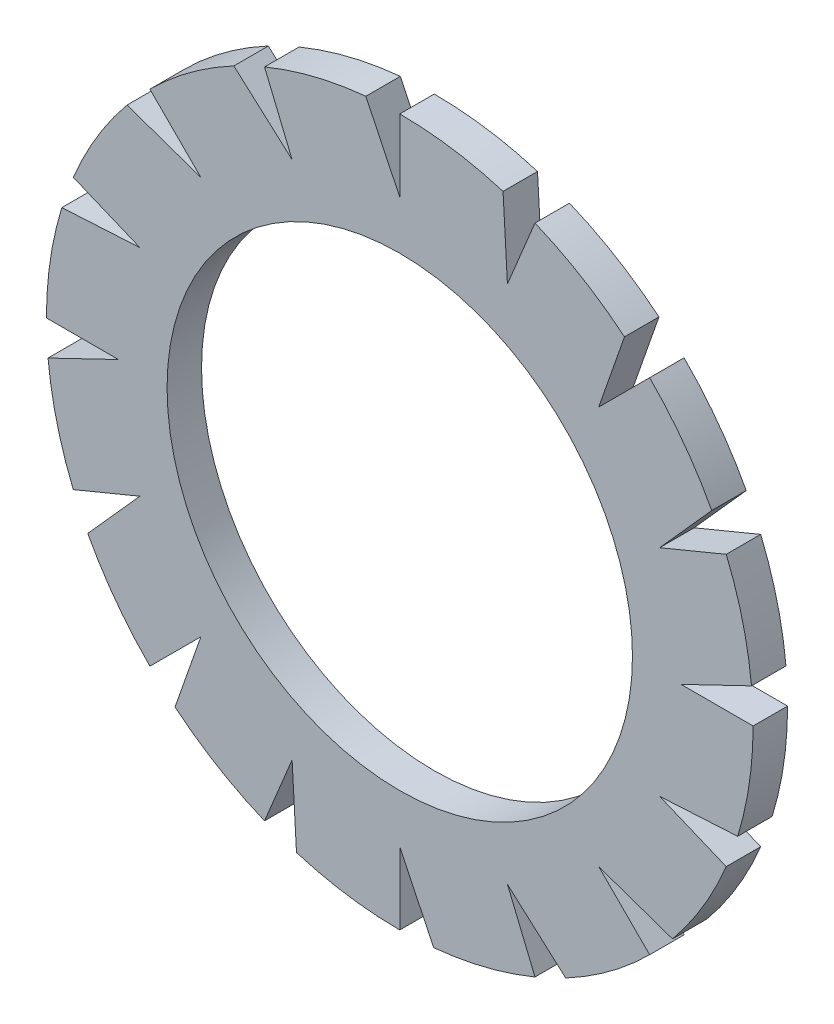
ISO-10303-21;
HEADER;
FILE_DESCRIPTION(('STEP AP214'),'2;1');
FILE_NAME('part.step','',(''),(''),'','','');
FILE_SCHEMA(('AUTOMOTIVE_DESIGN { 1 0 10303 214 1 1 1 1 }'));
ENDSEC;
DATA;
#1=APPLICATION_CONTEXT('core data for automotive mechanical design processes');
#2=APPLICATION_PROTOCOL_DEFINITION('international standard','automotive_design',2000,#1);
#3=PRODUCT_CONTEXT('',#1,'mechanical');
#4=PRODUCT('Part','Part','',(#3));
#5=PRODUCT_RELATED_PRODUCT_CATEGORY('part','',(#4));
#6=PRODUCT_DEFINITION_FORMATION('','',#4);
#7=PRODUCT_DEFINITION_CONTEXT('part definition',#1,'design');
#8=PRODUCT_DEFINITION('design','',#6,#7);
#9=PRODUCT_DEFINITION_SHAPE('','',#8);
#10=(LENGTH_UNIT() NAMED_UNIT(*) SI_UNIT(.MILLI.,.METRE.));
#11=(NAMED_UNIT(*) PLANE_ANGLE_UNIT() SI_UNIT($,.RADIAN.));
#12=(NAMED_UNIT(*) SI_UNIT($,.STERADIAN.) SOLID_ANGLE_UNIT());
#13=UNCERTAINTY_MEASURE_WITH_UNIT(LENGTH_MEASURE(1.E-05),#10,'distance_accuracy_value','');
#14=(GEOMETRIC_REPRESENTATION_CONTEXT(3) GLOBAL_UNCERTAINTY_ASSIGNED_CONTEXT((#13)) GLOBAL_UNIT_ASSIGNED_CONTEXT((#10,
#11,#12)) REPRESENTATION_CONTEXT('',''));
#15=CARTESIAN_POINT('',(0.,0.,0.));
#16=DIRECTION('',(0.,0.,1.));
#17=DIRECTION('',(1.,0.,0.));
#18=AXIS2_PLACEMENT_3D('',#15,#16,#17);
#19=CARTESIAN_POINT('',(0.,0.,0.));
#20=DIRECTION('',(0.,0.,1.));
#21=DIRECTION('',(1.,0.,0.));
#22=AXIS2_PLACEMENT_3D('',#19,#20,#21);
#23=CYLINDRICAL_SURFACE('',#22,10.25);
#24=DIRECTION('',(0.,0.,1.));
#25=VECTOR('',#24,1.);
#26=CARTESIAN_POINT('',(-3.92250518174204,9.46976520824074,-1.));
#27=LINE('',#26,#25);
#28=CARTESIAN_POINT('',(-3.92250518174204,9.46976520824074,-1.));
#29=VERTEX_POINT('',#28);
#30=CARTESIAN_POINT('',(-3.92250518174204,9.46976520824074,0.));
#31=VERTEX_POINT('',#30);
#32=EDGE_CURVE('E349',#29,#31,#27,.T.);
#33=ORIENTED_EDGE('',*,*,#32,.T.);
#34=CARTESIAN_POINT('',(0.,0.,0.));
#35=DIRECTION('',(0.,0.,1.));
#36=DIRECTION('',(1.,0.,0.));
#37=AXIS2_PLACEMENT_3D('',#34,#35,#36);
#38=CIRCLE('',#37,10.25);
#39=CARTESIAN_POINT('',(-0.983519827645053,10.2027049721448,0.));
#40=VERTEX_POINT('',#39);
#41=EDGE_CURVE('E628',#40,#31,#38,.T.);
#42=ORIENTED_EDGE('',*,*,#41,.F.);
#43=DIRECTION('',(0.,0.,1.));
#44=VECTOR('',#43,1.);
#45=CARTESIAN_POINT('',(-0.983519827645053,10.2027049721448,0.));
#46=LINE('',#45,#44);
#47=CARTESIAN_POINT('',(-0.983519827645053,10.2027049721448,-1.));
#48=VERTEX_POINT('',#47);
#49=EDGE_CURVE('E619',#48,#40,#46,.T.);
#50=ORIENTED_EDGE('',*,*,#49,.F.);
#51=CARTESIAN_POINT('',(0.,0.,-1.));
#52=DIRECTION('',(0.,0.,1.));
#53=DIRECTION('',(1.,0.,0.));
#54=AXIS2_PLACEMENT_3D('',#51,#52,#53);
#55=CIRCLE('',#54,10.25);
#56=EDGE_CURVE('E633',#48,#29,#55,.T.);
#57=ORIENTED_EDGE('',*,*,#56,.T.);
#58=EDGE_LOOP('',(#33,#42,#50,#57));
#59=FACE_BOUND('',#58,.T.);
#60=ADVANCED_FACE('F41',(#59),#23,.T.);
#61=DIRECTION('',(0.,0.,1.));
#62=VECTOR('',#61,1.);
#63=CARTESIAN_POINT('',(-4.81305999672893,9.04969355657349,0.));
#64=LINE('',#63,#62);
#65=CARTESIAN_POINT('',(-4.81305999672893,9.04969355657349,-1.));
#66=VERTEX_POINT('',#65);
#67=CARTESIAN_POINT('',(-4.81305999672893,9.04969355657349,0.));
#68=VERTEX_POINT('',#67);
#69=EDGE_CURVE('E54',#66,#68,#64,.T.);
#70=ORIENTED_EDGE('',*,*,#69,.F.);
#71=CARTESIAN_POINT('',(-7.24784450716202,7.2478445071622,-1.));
#72=VERTEX_POINT('',#71);
#73=EDGE_CURVE('E364',#66,#72,#55,.T.);
#74=ORIENTED_EDGE('',*,*,#73,.T.);
#75=DIRECTION('',(0.,0.,1.));
#76=VECTOR('',#75,1.);
#77=CARTESIAN_POINT('',(-7.24784450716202,7.2478445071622,-1.));
#78=LINE('',#77,#76);
#79=CARTESIAN_POINT('',(-7.24784450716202,7.2478445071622,0.));
#80=VERTEX_POINT('',#79);
#81=EDGE_CURVE('E379',#72,#80,#78,.T.);
#82=ORIENTED_EDGE('',*,*,#81,.T.);
#83=EDGE_CURVE('E635',#68,#80,#38,.T.);
#84=ORIENTED_EDGE('',*,*,#83,.F.);
#85=EDGE_LOOP('',(#70,#74,#82,#84));
#86=FACE_BOUND('',#85,.T.);
#87=ADVANCED_FACE('F801',(#86),#23,.T.);
#88=DIRECTION('',(0.,0.,1.));
#89=VECTOR('',#88,1.);
#90=CARTESIAN_POINT('',(-7.90985541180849,6.51894833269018,0.));
#91=LINE('',#90,#89);
#92=CARTESIAN_POINT('',(-7.90985541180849,6.51894833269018,-1.));
#93=VERTEX_POINT('',#92);
#94=CARTESIAN_POINT('',(-7.90985541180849,6.51894833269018,0.));
#95=VERTEX_POINT('',#94);
#96=EDGE_CURVE('E62',#93,#95,#91,.T.);
#97=ORIENTED_EDGE('',*,*,#96,.F.);
#98=CARTESIAN_POINT('',(-9.46976520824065,3.92250518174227,-1.));
#99=VERTEX_POINT('',#98);
#100=EDGE_CURVE('E793',#93,#99,#55,.T.);
#101=ORIENTED_EDGE('',*,*,#100,.T.);
#102=DIRECTION('',(0.,0.,1.));
#103=VECTOR('',#102,1.);
#104=CARTESIAN_POINT('',(-9.46976520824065,3.92250518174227,-1.));
#105=LINE('',#104,#103);
#106=CARTESIAN_POINT('',(-9.46976520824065,3.92250518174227,0.));
#107=VERTEX_POINT('',#106);
#108=EDGE_CURVE('E398',#99,#107,#105,.T.);
#109=ORIENTED_EDGE('',*,*,#108,.T.);
#110=EDGE_CURVE('E680',#95,#107,#38,.T.);
#111=ORIENTED_EDGE('',*,*,#110,.F.);
#112=EDGE_LOOP('',(#97,#101,#109,#111));
#113=FACE_BOUND('',#112,.T.);
#114=ADVANCED_FACE('F802',(#113),#23,.T.);
#115=DIRECTION('',(0.,0.,1.));
#116=VECTOR('',#115,1.);
#117=CARTESIAN_POINT('',(-9.80244704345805,2.99575231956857,0.));
#118=LINE('',#117,#116);
#119=CARTESIAN_POINT('',(-9.80244704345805,2.99575231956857,-1.));
#120=VERTEX_POINT('',#119);
#121=CARTESIAN_POINT('',(-9.80244704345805,2.99575231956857,0.));
#122=VERTEX_POINT('',#121);
#123=EDGE_CURVE('E399',#120,#122,#118,.T.);
#124=ORIENTED_EDGE('',*,*,#123,.F.);
#125=CARTESIAN_POINT('',(-10.25,1.07363051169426E-13,-1.));
#126=VERTEX_POINT('',#125);
#127=EDGE_CURVE('E787',#120,#126,#55,.T.);
#128=ORIENTED_EDGE('',*,*,#127,.T.);
#129=DIRECTION('',(0.,0.,1.));
#130=VECTOR('',#129,1.);
#131=CARTESIAN_POINT('',(-10.25,1.07363051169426E-13,-1.));
#132=LINE('',#131,#130);
#133=CARTESIAN_POINT('',(-10.25,1.07363051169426E-13,0.));
#134=VERTEX_POINT('',#133);
#135=EDGE_CURVE('E411',#126,#134,#132,.T.);
#136=ORIENTED_EDGE('',*,*,#135,.T.);
#137=EDGE_CURVE('E676',#122,#134,#38,.T.);
#138=ORIENTED_EDGE('',*,*,#137,.F.);
#139=EDGE_LOOP('',(#124,#128,#136,#138));
#140=FACE_BOUND('',#139,.T.);
#141=ADVANCED_FACE('F807',(#140),#23,.T.);
#142=DIRECTION('',(0.,0.,1.));
#143=VECTOR('',#142,1.);
#144=CARTESIAN_POINT('',(-10.2027049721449,-0.983519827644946,0.));
#145=LINE('',#144,#143);
#146=CARTESIAN_POINT('',(-10.2027049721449,-0.983519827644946,-1.));
#147=VERTEX_POINT('',#146);
#148=CARTESIAN_POINT('',(-10.2027049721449,-0.983519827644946,0.));
#149=VERTEX_POINT('',#148);
#150=EDGE_CURVE('E418',#147,#149,#145,.T.);
#151=ORIENTED_EDGE('',*,*,#150,.F.);
#152=CARTESIAN_POINT('',(-9.46976520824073,-3.92250518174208,-1.));
#153=VERTEX_POINT('',#152);
#154=EDGE_CURVE('E784',#147,#153,#55,.T.);
#155=ORIENTED_EDGE('',*,*,#154,.T.);
#156=DIRECTION('',(0.,0.,1.));
#157=VECTOR('',#156,1.);
#158=CARTESIAN_POINT('',(-9.46976520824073,-3.92250518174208,-1.));
#159=LINE('',#158,#157);
#160=CARTESIAN_POINT('',(-9.46976520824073,-3.92250518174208,0.));
#161=VERTEX_POINT('',#160);
#162=EDGE_CURVE('E427',#153,#161,#159,.T.);
#163=ORIENTED_EDGE('',*,*,#162,.T.);
#164=EDGE_CURVE('E677',#149,#161,#38,.T.);
#165=ORIENTED_EDGE('',*,*,#164,.F.);
#166=EDGE_LOOP('',(#151,#155,#163,#165));
#167=FACE_BOUND('',#166,.T.);
#168=ADVANCED_FACE('F818',(#167),#23,.T.);
#169=DIRECTION('',(0.,0.,1.));
#170=VECTOR('',#169,1.);
#171=CARTESIAN_POINT('',(-9.04969355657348,-4.81305999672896,0.));
#172=LINE('',#171,#170);
#173=CARTESIAN_POINT('',(-9.04969355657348,-4.81305999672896,-1.));
#174=VERTEX_POINT('',#173);
#175=CARTESIAN_POINT('',(-9.04969355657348,-4.81305999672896,0.));
#176=VERTEX_POINT('',#175);
#177=EDGE_CURVE('E433',#174,#176,#172,.T.);
#178=ORIENTED_EDGE('',*,*,#177,.F.);
#179=CARTESIAN_POINT('',(-7.24784450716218,-7.24784450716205,-1.));
#180=VERTEX_POINT('',#179);
#181=EDGE_CURVE('E779',#174,#180,#55,.T.);
#182=ORIENTED_EDGE('',*,*,#181,.T.);
#183=DIRECTION('',(0.,0.,1.));
#184=VECTOR('',#183,1.);
#185=CARTESIAN_POINT('',(-7.24784450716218,-7.24784450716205,-1.));
#186=LINE('',#185,#184);
#187=CARTESIAN_POINT('',(-7.24784450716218,-7.24784450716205,0.));
#188=VERTEX_POINT('',#187);
#189=EDGE_CURVE('E450',#180,#188,#186,.T.);
#190=ORIENTED_EDGE('',*,*,#189,.T.);
#191=EDGE_CURVE('E685',#176,#188,#38,.T.);
#192=ORIENTED_EDGE('',*,*,#191,.F.);
#193=EDGE_LOOP('',(#178,#182,#190,#192));
#194=FACE_BOUND('',#193,.T.);
#195=ADVANCED_FACE('F825',(#194),#23,.T.);
#196=DIRECTION('',(0.,0.,1.));
#197=VECTOR('',#196,1.);
#198=CARTESIAN_POINT('',(-6.51894833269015,-7.90985541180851,0.));
#199=LINE('',#198,#197);
#200=CARTESIAN_POINT('',(-6.51894833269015,-7.90985541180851,-1.));
#201=VERTEX_POINT('',#200);
#202=CARTESIAN_POINT('',(-6.51894833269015,-7.90985541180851,0.));
#203=VERTEX_POINT('',#202);
#204=EDGE_CURVE('E448',#201,#203,#199,.T.);
#205=ORIENTED_EDGE('',*,*,#204,.F.);
#206=CARTESIAN_POINT('',(-3.92250518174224,-9.46976520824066,-1.));
#207=VERTEX_POINT('',#206);
#208=EDGE_CURVE('E773',#201,#207,#55,.T.);
#209=ORIENTED_EDGE('',*,*,#208,.T.);
#210=DIRECTION('',(0.,0.,1.));
#211=VECTOR('',#210,1.);
#212=CARTESIAN_POINT('',(-3.92250518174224,-9.46976520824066,-1.));
#213=LINE('',#212,#211);
#214=CARTESIAN_POINT('',(-3.92250518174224,-9.46976520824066,0.));
#215=VERTEX_POINT('',#214);
#216=EDGE_CURVE('E464',#207,#215,#213,.T.);
#217=ORIENTED_EDGE('',*,*,#216,.T.);
#218=EDGE_CURVE('E686',#203,#215,#38,.T.);
#219=ORIENTED_EDGE('',*,*,#218,.F.);
#220=EDGE_LOOP('',(#205,#209,#217,#219));
#221=FACE_BOUND('',#220,.T.);
#222=ADVANCED_FACE('F828',(#221),#23,.T.);
#223=DIRECTION('',(0.,0.,1.));
#224=VECTOR('',#223,1.);
#225=CARTESIAN_POINT('',(-2.99575231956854,-9.80244704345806,0.));
#226=LINE('',#225,#224);
#227=CARTESIAN_POINT('',(-2.99575231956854,-9.80244704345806,-1.));
#228=VERTEX_POINT('',#227);
#229=CARTESIAN_POINT('',(-2.99575231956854,-9.80244704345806,0.));
#230=VERTEX_POINT('',#229);
#231=EDGE_CURVE('E470',#228,#230,#226,.T.);
#232=ORIENTED_EDGE('',*,*,#231,.F.);
#233=CARTESIAN_POINT('',(0.,-10.25,-1.));
#234=VERTEX_POINT('',#233);
#235=EDGE_CURVE('E769',#228,#234,#55,.T.);
#236=ORIENTED_EDGE('',*,*,#235,.T.);
#237=DIRECTION('',(0.,0.,1.));
#238=VECTOR('',#237,1.);
#239=CARTESIAN_POINT('',(0.,-10.25,-1.));
#240=LINE('',#239,#238);
#241=CARTESIAN_POINT('',(0.,-10.25,0.));
#242=VERTEX_POINT('',#241);
#243=EDGE_CURVE('E483',#234,#242,#240,.T.);
#244=ORIENTED_EDGE('',*,*,#243,.T.);
#245=EDGE_CURVE('E695',#230,#242,#38,.T.);
#246=ORIENTED_EDGE('',*,*,#245,.F.);
#247=EDGE_LOOP('',(#232,#236,#244,#246));
#248=FACE_BOUND('',#247,.T.);
#249=ADVANCED_FACE('F833',(#248),#23,.T.);
#250=DIRECTION('',(0.,0.,1.));
#251=VECTOR('',#250,1.);
#252=CARTESIAN_POINT('',(0.983519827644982,-10.2027049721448,0.));
#253=LINE('',#252,#251);
#254=CARTESIAN_POINT('',(0.983519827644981,-10.2027049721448,-1.));
#255=VERTEX_POINT('',#254);
#256=CARTESIAN_POINT('',(0.98351982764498,-10.2027049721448,0.));
#257=VERTEX_POINT('',#256);
#258=EDGE_CURVE('E484',#255,#257,#253,.T.);
#259=ORIENTED_EDGE('',*,*,#258,.F.);
#260=CARTESIAN_POINT('',(3.92250518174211,-9.46976520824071,-1.));
#261=VERTEX_POINT('',#260);
#262=EDGE_CURVE('E764',#255,#261,#55,.T.);
#263=ORIENTED_EDGE('',*,*,#262,.T.);
#264=DIRECTION('',(0.,0.,1.));
#265=VECTOR('',#264,1.);
#266=CARTESIAN_POINT('',(3.92250518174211,-9.46976520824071,-1.));
#267=LINE('',#266,#265);
#268=CARTESIAN_POINT('',(3.92250518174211,-9.46976520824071,0.));
#269=VERTEX_POINT('',#268);
#270=EDGE_CURVE('E498',#261,#269,#267,.T.);
#271=ORIENTED_EDGE('',*,*,#270,.T.);
#272=EDGE_CURVE('E696',#257,#269,#38,.T.);
#273=ORIENTED_EDGE('',*,*,#272,.F.);
#274=EDGE_LOOP('',(#259,#263,#271,#273));
#275=FACE_BOUND('',#274,.T.);
#276=ADVANCED_FACE('F838',(#275),#23,.T.);
#277=DIRECTION('',(0.,0.,1.));
#278=VECTOR('',#277,1.);
#279=CARTESIAN_POINT('',(4.81305999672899,-9.04969355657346,0.));
#280=LINE('',#279,#278);
#281=CARTESIAN_POINT('',(4.81305999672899,-9.04969355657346,-1.));
#282=VERTEX_POINT('',#281);
#283=CARTESIAN_POINT('',(4.81305999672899,-9.04969355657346,0.));
#284=VERTEX_POINT('',#283);
#285=EDGE_CURVE('E501',#282,#284,#280,.T.);
#286=ORIENTED_EDGE('',*,*,#285,.F.);
#287=CARTESIAN_POINT('',(7.24784450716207,-7.24784450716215,-1.));
#288=VERTEX_POINT('',#287);
#289=EDGE_CURVE('E759',#282,#288,#55,.T.);
#290=ORIENTED_EDGE('',*,*,#289,.T.);
#291=DIRECTION('',(0.,0.,1.));
#292=VECTOR('',#291,1.);
#293=CARTESIAN_POINT('',(7.24784450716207,-7.24784450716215,-1.));
#294=LINE('',#293,#292);
#295=CARTESIAN_POINT('',(7.24784450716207,-7.24784450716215,0.));
#296=VERTEX_POINT('',#295);
#297=EDGE_CURVE('E513',#288,#296,#294,.T.);
#298=ORIENTED_EDGE('',*,*,#297,.T.);
#299=EDGE_CURVE('E699',#284,#296,#38,.T.);
#300=ORIENTED_EDGE('',*,*,#299,.F.);
#301=EDGE_LOOP('',(#286,#290,#298,#300));
#302=FACE_BOUND('',#301,.T.);
#303=ADVANCED_FACE('F848',(#302),#23,.T.);
#304=DIRECTION('',(0.,0.,1.));
#305=VECTOR('',#304,1.);
#306=CARTESIAN_POINT('',(7.90985541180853,-6.51894833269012,0.));
#307=LINE('',#306,#305);
#308=CARTESIAN_POINT('',(7.90985541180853,-6.51894833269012,-1.));
#309=VERTEX_POINT('',#308);
#310=CARTESIAN_POINT('',(7.90985541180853,-6.51894833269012,0.));
#311=VERTEX_POINT('',#310);
#312=EDGE_CURVE('E517',#309,#311,#307,.T.);
#313=ORIENTED_EDGE('',*,*,#312,.F.);
#314=CARTESIAN_POINT('',(9.46976520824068,-3.92250518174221,-1.));
#315=VERTEX_POINT('',#314);
#316=EDGE_CURVE('E752',#309,#315,#55,.T.);
#317=ORIENTED_EDGE('',*,*,#316,.T.);
#318=DIRECTION('',(0.,0.,1.));
#319=VECTOR('',#318,1.);
#320=CARTESIAN_POINT('',(9.46976520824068,-3.92250518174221,-1.));
#321=LINE('',#320,#319);
#322=CARTESIAN_POINT('',(9.46976520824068,-3.92250518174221,0.));
#323=VERTEX_POINT('',#322);
#324=EDGE_CURVE('E535',#315,#323,#321,.T.);
#325=ORIENTED_EDGE('',*,*,#324,.T.);
#326=EDGE_CURVE('E703',#311,#323,#38,.T.);
#327=ORIENTED_EDGE('',*,*,#326,.F.);
#328=EDGE_LOOP('',(#313,#317,#325,#327));
#329=FACE_BOUND('',#328,.T.);
#330=ADVANCED_FACE('F855',(#329),#23,.T.);
#331=DIRECTION('',(0.,0.,1.));
#332=VECTOR('',#331,1.);
#333=CARTESIAN_POINT('',(9.80244704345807,-2.99575231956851,0.));
#334=LINE('',#333,#332);
#335=CARTESIAN_POINT('',(9.80244704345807,-2.99575231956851,-1.));
#336=VERTEX_POINT('',#335);
#337=CARTESIAN_POINT('',(9.80244704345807,-2.99575231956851,0.));
#338=VERTEX_POINT('',#337);
#339=EDGE_CURVE('E533',#336,#338,#334,.T.);
#340=ORIENTED_EDGE('',*,*,#339,.F.);
#341=CARTESIAN_POINT('',(10.25,0.,-1.));
#342=VERTEX_POINT('',#341);
#343=EDGE_CURVE('E749',#336,#342,#55,.T.);
#344=ORIENTED_EDGE('',*,*,#343,.T.);
#345=DIRECTION('',(0.,0.,1.));
#346=VECTOR('',#345,1.);
#347=CARTESIAN_POINT('',(10.25,0.,-1.));
#348=LINE('',#347,#346);
#349=CARTESIAN_POINT('',(10.25,0.,0.));
#350=VERTEX_POINT('',#349);
#351=EDGE_CURVE('E549',#342,#350,#348,.T.);
#352=ORIENTED_EDGE('',*,*,#351,.T.);
#353=EDGE_CURVE('E709',#338,#350,#38,.T.);
#354=ORIENTED_EDGE('',*,*,#353,.F.);
#355=EDGE_LOOP('',(#340,#344,#352,#354));
#356=FACE_BOUND('',#355,.T.);
#357=ADVANCED_FACE('F856',(#356),#23,.T.);
#358=DIRECTION('',(0.,0.,1.));
#359=VECTOR('',#358,1.);
#360=CARTESIAN_POINT('',(10.2027049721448,0.983519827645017,0.));
#361=LINE('',#360,#359);
#362=CARTESIAN_POINT('',(10.2027049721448,0.983519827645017,-1.));
#363=VERTEX_POINT('',#362);
#364=CARTESIAN_POINT('',(10.2027049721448,0.983519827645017,0.));
#365=VERTEX_POINT('',#364);
#366=EDGE_CURVE('E552',#363,#365,#361,.T.);
#367=ORIENTED_EDGE('',*,*,#366,.F.);
#368=CARTESIAN_POINT('',(9.4697652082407,3.92250518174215,-1.));
#369=VERTEX_POINT('',#368);
#370=EDGE_CURVE('E742',#363,#369,#55,.T.);
#371=ORIENTED_EDGE('',*,*,#370,.T.);
#372=DIRECTION('',(0.,0.,1.));
#373=VECTOR('',#372,1.);
#374=CARTESIAN_POINT('',(9.4697652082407,3.92250518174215,-1.));
#375=LINE('',#374,#373);
#376=CARTESIAN_POINT('',(9.4697652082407,3.92250518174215,0.));
#377=VERTEX_POINT('',#376);
#378=EDGE_CURVE('E566',#369,#377,#375,.T.);
#379=ORIENTED_EDGE('',*,*,#378,.T.);
#380=EDGE_CURVE('E715',#365,#377,#38,.T.);
#381=ORIENTED_EDGE('',*,*,#380,.F.);
#382=EDGE_LOOP('',(#367,#371,#379,#381));
#383=FACE_BOUND('',#382,.T.);
#384=ADVANCED_FACE('F863',(#383),#23,.T.);
#385=DIRECTION('',(0.,0.,1.));
#386=VECTOR('',#385,1.);
#387=CARTESIAN_POINT('',(9.04969355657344,4.81305999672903,0.));
#388=LINE('',#387,#386);
#389=CARTESIAN_POINT('',(9.04969355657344,4.81305999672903,-1.));
#390=VERTEX_POINT('',#389);
#391=CARTESIAN_POINT('',(9.04969355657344,4.81305999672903,0.));
#392=VERTEX_POINT('',#391);
#393=EDGE_CURVE('E567',#390,#392,#388,.T.);
#394=ORIENTED_EDGE('',*,*,#393,.F.);
#395=CARTESIAN_POINT('',(7.24784450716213,7.2478445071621,-1.));
#396=VERTEX_POINT('',#395);
#397=EDGE_CURVE('E739',#390,#396,#55,.T.);
#398=ORIENTED_EDGE('',*,*,#397,.T.);
#399=DIRECTION('',(0.,0.,1.));
#400=VECTOR('',#399,1.);
#401=CARTESIAN_POINT('',(7.24784450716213,7.2478445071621,-1.));
#402=LINE('',#401,#400);
#403=CARTESIAN_POINT('',(7.24784450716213,7.2478445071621,0.));
#404=VERTEX_POINT('',#403);
#405=EDGE_CURVE('E582',#396,#404,#402,.T.);
#406=ORIENTED_EDGE('',*,*,#405,.T.);
#407=EDGE_CURVE('E718',#392,#404,#38,.T.);
#408=ORIENTED_EDGE('',*,*,#407,.F.);
#409=EDGE_LOOP('',(#394,#398,#406,#408));
#410=FACE_BOUND('',#409,.T.);
#411=ADVANCED_FACE('F869',(#410),#23,.T.);
#412=DIRECTION('',(0.,0.,1.));
#413=VECTOR('',#412,1.);
#414=CARTESIAN_POINT('',(6.51894833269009,7.90985541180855,0.));
#415=LINE('',#414,#413);
#416=CARTESIAN_POINT('',(6.51894833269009,7.90985541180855,-1.));
#417=VERTEX_POINT('',#416);
#418=CARTESIAN_POINT('',(6.51894833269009,7.90985541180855,0.));
#419=VERTEX_POINT('',#418);
#420=EDGE_CURVE('E588',#417,#419,#415,.T.);
#421=ORIENTED_EDGE('',*,*,#420,.F.);
#422=CARTESIAN_POINT('',(3.92250518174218,9.46976520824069,-1.));
#423=VERTEX_POINT('',#422);
#424=EDGE_CURVE('E737',#417,#423,#55,.T.);
#425=ORIENTED_EDGE('',*,*,#424,.T.);
#426=DIRECTION('',(0.,0.,1.));
#427=VECTOR('',#426,1.);
#428=CARTESIAN_POINT('',(3.92250518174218,9.46976520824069,-1.));
#429=LINE('',#428,#427);
#430=CARTESIAN_POINT('',(3.92250518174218,9.46976520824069,0.));
#431=VERTEX_POINT('',#430);
#432=EDGE_CURVE('E598',#423,#431,#429,.T.);
#433=ORIENTED_EDGE('',*,*,#432,.T.);
#434=EDGE_CURVE('E719',#419,#431,#38,.T.);
#435=ORIENTED_EDGE('',*,*,#434,.F.);
#436=EDGE_LOOP('',(#421,#425,#433,#435));
#437=FACE_BOUND('',#436,.T.);
#438=ADVANCED_FACE('F878',(#437),#23,.T.);
#439=CARTESIAN_POINT('',(0.,0.,0.));
#440=DIRECTION('',(0.,0.,1.));
#441=DIRECTION('',(1.,0.,0.));
#442=AXIS2_PLACEMENT_3D('',#439,#440,#441);
#443=CYLINDRICAL_SURFACE('',#442,6.75);
#444=CARTESIAN_POINT('',(0.,0.,0.));
#445=DIRECTION('',(0.,0.,1.));
#446=DIRECTION('',(1.,0.,0.));
#447=AXIS2_PLACEMENT_3D('',#444,#445,#446);
#448=CIRCLE('',#447,6.75);
#449=CARTESIAN_POINT('',(6.75,0.,0.));
#450=VERTEX_POINT('',#449);
#451=EDGE_CURVE('E624',#450,#450,#448,.T.);
#452=ORIENTED_EDGE('',*,*,#451,.T.);
#453=EDGE_LOOP('',(#452));
#454=FACE_BOUND('',#453,.T.);
#455=CARTESIAN_POINT('',(0.,0.,-1.));
#456=DIRECTION('',(0.,0.,1.));
#457=DIRECTION('',(1.,0.,0.));
#458=AXIS2_PLACEMENT_3D('',#455,#456,#457);
#459=CIRCLE('',#458,6.75);
#460=CARTESIAN_POINT('',(6.75,0.,-1.));
#461=VERTEX_POINT('',#460);
#462=EDGE_CURVE('E634',#461,#461,#459,.T.);
#463=ORIENTED_EDGE('',*,*,#462,.F.);
#464=EDGE_LOOP('',(#463));
#465=FACE_BOUND('',#464,.T.);
#466=ADVANCED_FACE('F43',(#454,#465),#443,.F.);
#467=CARTESIAN_POINT('',(6.75,0.,-1.));
#468=DIRECTION('',(0.,0.,-1.));
#469=DIRECTION('',(-1.,0.,0.));
#470=AXIS2_PLACEMENT_3D('',#467,#468,#469);
#471=PLANE('',#470);
#472=DIRECTION('',(-0.382683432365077,0.923879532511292,0.));
#473=VECTOR('',#472,1.);
#474=CARTESIAN_POINT('',(-3.12269680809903,7.53885698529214,-1.));
#475=LINE('',#474,#473);
#476=CARTESIAN_POINT('',(-3.12269680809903,7.53885698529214,-1.));
#477=VERTEX_POINT('',#476);
#478=EDGE_CURVE('E353',#477,#29,#475,.T.);
#479=ORIENTED_EDGE('',*,*,#478,.T.);
#480=ORIENTED_EDGE('',*,*,#56,.F.);
#481=DIRECTION('',(0.433813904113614,-0.901002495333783,0.));
#482=VECTOR('',#481,1.);
#483=CARTESIAN_POINT('',(0.,8.16,-1.));
#484=LINE('',#483,#482);
#485=CARTESIAN_POINT('',(0.,8.16,-1.));
#486=VERTEX_POINT('',#485);
#487=EDGE_CURVE('E606',#48,#486,#484,.T.);
#488=ORIENTED_EDGE('',*,*,#487,.T.);
#489=DIRECTION('',(0.,1.,0.));
#490=VECTOR('',#489,1.);
#491=CARTESIAN_POINT('',(0.,8.16,-1.));
#492=LINE('',#491,#490);
#493=CARTESIAN_POINT('',(0.,10.25,-1.));
#494=VERTEX_POINT('',#493);
#495=EDGE_CURVE('E613',#486,#494,#492,.T.);
#496=ORIENTED_EDGE('',*,*,#495,.T.);
#497=CARTESIAN_POINT('',(2.99575231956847,9.80244704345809,-1.));
#498=VERTEX_POINT('',#497);
#499=EDGE_CURVE('E631',#498,#494,#55,.T.);
#500=ORIENTED_EDGE('',*,*,#499,.F.);
#501=DIRECTION('',(0.0559930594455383,-0.998431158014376,0.));
#502=VECTOR('',#501,1.);
#503=CARTESIAN_POINT('',(3.12269680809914,7.5388569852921,-1.));
#504=LINE('',#503,#502);
#505=CARTESIAN_POINT('',(3.12269680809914,7.5388569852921,-1.));
#506=VERTEX_POINT('',#505);
#507=EDGE_CURVE('E593',#498,#506,#504,.T.);
#508=ORIENTED_EDGE('',*,*,#507,.T.);
#509=DIRECTION('',(0.382683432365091,0.923879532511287,0.));
#510=VECTOR('',#509,1.);
#511=CARTESIAN_POINT('',(3.12269680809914,7.5388569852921,-1.));
#512=LINE('',#511,#510);
#513=EDGE_CURVE('E594',#506,#423,#512,.T.);
#514=ORIENTED_EDGE('',*,*,#513,.T.);
#515=ORIENTED_EDGE('',*,*,#424,.F.);
#516=DIRECTION('',(-0.330352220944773,-0.943857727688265,0.));
#517=VECTOR('',#516,1.);
#518=CARTESIAN_POINT('',(5.76999133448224,5.76999133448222,-1.));
#519=LINE('',#518,#517);
#520=CARTESIAN_POINT('',(5.76999133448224,5.76999133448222,-1.));
#521=VERTEX_POINT('',#520);
#522=EDGE_CURVE('E573',#417,#521,#519,.T.);
#523=ORIENTED_EDGE('',*,*,#522,.T.);
#524=DIRECTION('',(0.707106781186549,0.707106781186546,0.));
#525=VECTOR('',#524,1.);
#526=CARTESIAN_POINT('',(5.76999133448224,5.76999133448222,-1.));
#527=LINE('',#526,#525);
#528=EDGE_CURVE('E580',#521,#396,#527,.T.);
#529=ORIENTED_EDGE('',*,*,#528,.T.);
#530=ORIENTED_EDGE('',*,*,#397,.F.);
#531=DIRECTION('',(-0.666404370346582,-0.745590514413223,0.));
#532=VECTOR('',#531,1.);
#533=CARTESIAN_POINT('',(7.53885698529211,3.12269680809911,-1.));
#534=LINE('',#533,#532);
#535=CARTESIAN_POINT('',(7.53885698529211,3.12269680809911,-1.));
#536=VERTEX_POINT('',#535);
#537=EDGE_CURVE('E560',#390,#536,#534,.T.);
#538=ORIENTED_EDGE('',*,*,#537,.T.);
#539=DIRECTION('',(0.923879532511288,0.382683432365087,0.));
#540=VECTOR('',#539,1.);
#541=CARTESIAN_POINT('',(7.53885698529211,3.12269680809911,-1.));
#542=LINE('',#541,#540);
#543=EDGE_CURVE('E557',#536,#369,#542,.T.);
#544=ORIENTED_EDGE('',*,*,#543,.T.);
#545=ORIENTED_EDGE('',*,*,#370,.F.);
#546=DIRECTION('',(-0.901002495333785,-0.433813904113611,0.));
#547=VECTOR('',#546,1.);
#548=CARTESIAN_POINT('',(8.16,0.,-1.));
#549=LINE('',#548,#547);
#550=CARTESIAN_POINT('',(8.16,0.,-1.));
#551=VERTEX_POINT('',#550);
#552=EDGE_CURVE('E539',#363,#551,#549,.T.);
#553=ORIENTED_EDGE('',*,*,#552,.T.);
#554=DIRECTION('',(1.,0.,0.));
#555=VECTOR('',#554,1.);
#556=CARTESIAN_POINT('',(8.16,0.,-1.));
#557=LINE('',#556,#555);
#558=EDGE_CURVE('E541',#551,#342,#557,.T.);
#559=ORIENTED_EDGE('',*,*,#558,.T.);
#560=ORIENTED_EDGE('',*,*,#343,.F.);
#561=DIRECTION('',(-0.998431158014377,-0.0559930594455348,0.));
#562=VECTOR('',#561,1.);
#563=CARTESIAN_POINT('',(7.53885698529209,-3.12269680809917,-1.));
#564=LINE('',#563,#562);
#565=CARTESIAN_POINT('',(7.53885698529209,-3.12269680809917,-1.));
#566=VERTEX_POINT('',#565);
#567=EDGE_CURVE('E521',#336,#566,#564,.T.);
#568=ORIENTED_EDGE('',*,*,#567,.T.);
#569=DIRECTION('',(0.923879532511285,-0.382683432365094,0.));
#570=VECTOR('',#569,1.);
#571=CARTESIAN_POINT('',(7.53885698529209,-3.12269680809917,-1.));
#572=LINE('',#571,#570);
#573=EDGE_CURVE('E528',#566,#315,#572,.T.);
#574=ORIENTED_EDGE('',*,*,#573,.T.);
#575=ORIENTED_EDGE('',*,*,#316,.F.);
#576=DIRECTION('',(-0.943857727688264,0.330352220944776,0.));
#577=VECTOR('',#576,1.);
#578=CARTESIAN_POINT('',(5.7699913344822,-5.76999133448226,-1.));
#579=LINE('',#578,#577);
#580=CARTESIAN_POINT('',(5.7699913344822,-5.76999133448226,-1.));
#581=VERTEX_POINT('',#580);
#582=EDGE_CURVE('E506',#309,#581,#579,.T.);
#583=ORIENTED_EDGE('',*,*,#582,.T.);
#584=DIRECTION('',(0.707106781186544,-0.707106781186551,0.));
#585=VECTOR('',#584,1.);
#586=CARTESIAN_POINT('',(5.7699913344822,-5.76999133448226,-1.));
#587=LINE('',#586,#585);
#588=EDGE_CURVE('E508',#581,#288,#587,.T.);
#589=ORIENTED_EDGE('',*,*,#588,.T.);
#590=ORIENTED_EDGE('',*,*,#289,.F.);
#591=DIRECTION('',(-0.745590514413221,0.666404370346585,0.));
#592=VECTOR('',#591,1.);
#593=CARTESIAN_POINT('',(3.12269680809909,-7.53885698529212,-1.));
#594=LINE('',#593,#592);
#595=CARTESIAN_POINT('',(3.12269680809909,-7.53885698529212,-1.));
#596=VERTEX_POINT('',#595);
#597=EDGE_CURVE('E490',#282,#596,#594,.T.);
#598=ORIENTED_EDGE('',*,*,#597,.T.);
#599=DIRECTION('',(0.382683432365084,-0.923879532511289,0.));
#600=VECTOR('',#599,1.);
#601=CARTESIAN_POINT('',(3.12269680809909,-7.53885698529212,-1.));
#602=LINE('',#601,#600);
#603=EDGE_CURVE('E495',#596,#261,#602,.T.);
#604=ORIENTED_EDGE('',*,*,#603,.T.);
#605=ORIENTED_EDGE('',*,*,#262,.F.);
#606=DIRECTION('',(-0.433813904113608,0.901002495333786,0.));
#607=VECTOR('',#606,1.);
#608=CARTESIAN_POINT('',(0.,-8.16,-1.));
#609=LINE('',#608,#607);
#610=CARTESIAN_POINT('',(0.,-8.16,-1.));
#611=VERTEX_POINT('',#610);
#612=EDGE_CURVE('E475',#255,#611,#609,.T.);
#613=ORIENTED_EDGE('',*,*,#612,.T.);
#614=DIRECTION('',(0.,-1.,0.));
#615=VECTOR('',#614,1.);
#616=CARTESIAN_POINT('',(0.,-8.16,-1.));
#617=LINE('',#616,#615);
#618=EDGE_CURVE('E474',#611,#234,#617,.T.);
#619=ORIENTED_EDGE('',*,*,#618,.T.);
#620=ORIENTED_EDGE('',*,*,#235,.F.);
#621=DIRECTION('',(-0.0559930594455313,0.998431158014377,0.));
#622=VECTOR('',#621,1.);
#623=CARTESIAN_POINT('',(-3.12269680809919,-7.53885698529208,-1.));
#624=LINE('',#623,#622);
#625=CARTESIAN_POINT('',(-3.12269680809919,-7.53885698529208,-1.));
#626=VERTEX_POINT('',#625);
#627=EDGE_CURVE('E454',#228,#626,#624,.T.);
#628=ORIENTED_EDGE('',*,*,#627,.T.);
#629=DIRECTION('',(-0.382683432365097,-0.923879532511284,0.));
#630=VECTOR('',#629,1.);
#631=CARTESIAN_POINT('',(-3.12269680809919,-7.53885698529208,-1.));
#632=LINE('',#631,#630);
#633=EDGE_CURVE('E456',#626,#207,#632,.T.);
#634=ORIENTED_EDGE('',*,*,#633,.T.);
#635=ORIENTED_EDGE('',*,*,#208,.F.);
#636=DIRECTION('',(0.33035222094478,0.943857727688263,0.));
#637=VECTOR('',#636,1.);
#638=CARTESIAN_POINT('',(-5.76999133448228,-5.76999133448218,-1.));
#639=LINE('',#638,#637);
#640=CARTESIAN_POINT('',(-5.76999133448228,-5.76999133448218,-1.));
#641=VERTEX_POINT('',#640);
#642=EDGE_CURVE('E438',#201,#641,#639,.T.);
#643=ORIENTED_EDGE('',*,*,#642,.T.);
#644=DIRECTION('',(-0.707106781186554,-0.707106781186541,0.));
#645=VECTOR('',#644,1.);
#646=CARTESIAN_POINT('',(-5.76999133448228,-5.76999133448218,-1.));
#647=LINE('',#646,#645);
#648=EDGE_CURVE('E441',#641,#180,#647,.T.);
#649=ORIENTED_EDGE('',*,*,#648,.T.);
#650=ORIENTED_EDGE('',*,*,#181,.F.);
#651=DIRECTION('',(0.666404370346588,0.745590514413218,0.));
#652=VECTOR('',#651,1.);
#653=CARTESIAN_POINT('',(-7.53885698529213,-3.12269680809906,-1.));
#654=LINE('',#653,#652);
#655=CARTESIAN_POINT('',(-7.53885698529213,-3.12269680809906,-1.));
#656=VERTEX_POINT('',#655);
#657=EDGE_CURVE('E423',#174,#656,#654,.T.);
#658=ORIENTED_EDGE('',*,*,#657,.T.);
#659=DIRECTION('',(-0.923879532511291,-0.382683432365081,0.));
#660=VECTOR('',#659,1.);
#661=CARTESIAN_POINT('',(-7.53885698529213,-3.12269680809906,-1.));
#662=LINE('',#661,#660);
#663=EDGE_CURVE('E425',#656,#153,#662,.T.);
#664=ORIENTED_EDGE('',*,*,#663,.T.);
#665=ORIENTED_EDGE('',*,*,#154,.F.);
#666=DIRECTION('',(0.901002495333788,0.433813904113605,0.));
#667=VECTOR('',#666,1.);
#668=CARTESIAN_POINT('',(-8.16,0.,-1.));
#669=LINE('',#668,#667);
#670=CARTESIAN_POINT('',(-8.16,0.,-1.));
#671=VERTEX_POINT('',#670);
#672=EDGE_CURVE('E404',#147,#671,#669,.T.);
#673=ORIENTED_EDGE('',*,*,#672,.T.);
#674=DIRECTION('',(-1.,0.,0.));
#675=VECTOR('',#674,1.);
#676=CARTESIAN_POINT('',(-8.16,0.,-1.));
#677=LINE('',#676,#675);
#678=EDGE_CURVE('E410',#671,#126,#677,.T.);
#679=ORIENTED_EDGE('',*,*,#678,.T.);
#680=ORIENTED_EDGE('',*,*,#127,.F.);
#681=DIRECTION('',(0.998431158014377,0.0559930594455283,0.));
#682=VECTOR('',#681,1.);
#683=CARTESIAN_POINT('',(-7.53885698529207,3.12269680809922,-1.));
#684=LINE('',#683,#682);
#685=CARTESIAN_POINT('',(-7.53885698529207,3.12269680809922,-1.));
#686=VERTEX_POINT('',#685);
#687=EDGE_CURVE('E390',#120,#686,#684,.T.);
#688=ORIENTED_EDGE('',*,*,#687,.T.);
#689=DIRECTION('',(-0.923879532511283,0.3826834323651,0.));
#690=VECTOR('',#689,1.);
#691=CARTESIAN_POINT('',(-7.53885698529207,3.12269680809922,-1.));
#692=LINE('',#691,#690);
#693=EDGE_CURVE('E389',#686,#99,#692,.T.);
#694=ORIENTED_EDGE('',*,*,#693,.T.);
#695=ORIENTED_EDGE('',*,*,#100,.F.);
#696=DIRECTION('',(0.943857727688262,-0.330352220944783,0.));
#697=VECTOR('',#696,1.);
#698=CARTESIAN_POINT('',(-5.76999133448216,5.7699913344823,-1.));
#699=LINE('',#698,#697);
#700=CARTESIAN_POINT('',(-5.76999133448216,5.7699913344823,-1.));
#701=VERTEX_POINT('',#700);
#702=EDGE_CURVE('E375',#93,#701,#699,.T.);
#703=ORIENTED_EDGE('',*,*,#702,.T.);
#704=DIRECTION('',(-0.707106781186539,0.707106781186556,0.));
#705=VECTOR('',#704,1.);
#706=CARTESIAN_POINT('',(-5.76999133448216,5.7699913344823,-1.));
#707=LINE('',#706,#705);
#708=EDGE_CURVE('E374',#701,#72,#707,.T.);
#709=ORIENTED_EDGE('',*,*,#708,.T.);
#710=ORIENTED_EDGE('',*,*,#73,.F.);
#711=DIRECTION('',(0.745590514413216,-0.666404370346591,0.));
#712=VECTOR('',#711,1.);
#713=CARTESIAN_POINT('',(-3.12269680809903,7.53885698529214,-1.));
#714=LINE('',#713,#712);
#715=EDGE_CURVE('E350',#66,#477,#714,.T.);
#716=ORIENTED_EDGE('',*,*,#715,.T.);
#717=EDGE_LOOP('',(#479,#480,#488,#496,#500,#508,#514,#515,#523,#529,#530,#538,#544,#545,#553,
#559,#560,#568,#574,#575,#583,#589,#590,#598,#604,#605,#613,#619,#620,#628,#634,#635,#643,#649,
#650,#658,#664,#665,#673,#679,#680,#688,#694,#695,#703,#709,#710,#716));
#718=FACE_BOUND('',#717,.T.);
#719=ORIENTED_EDGE('',*,*,#462,.T.);
#720=EDGE_LOOP('',(#719));
#721=FACE_BOUND('',#720,.T.);
#722=ADVANCED_FACE('F363',(#718,#721),#471,.T.);
#723=DIRECTION('',(0.,0.,1.));
#724=VECTOR('',#723,1.);
#725=CARTESIAN_POINT('',(2.99575231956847,9.80244704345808,0.));
#726=LINE('',#725,#724);
#727=CARTESIAN_POINT('',(2.99575231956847,9.80244704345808,0.));
#728=VERTEX_POINT('',#727);
#729=EDGE_CURVE('E602',#498,#728,#726,.T.);
#730=ORIENTED_EDGE('',*,*,#729,.F.);
#731=ORIENTED_EDGE('',*,*,#499,.T.);
#732=DIRECTION('',(0.,0.,1.));
#733=VECTOR('',#732,1.);
#734=CARTESIAN_POINT('',(0.,10.25,-1.));
#735=LINE('',#734,#733);
#736=CARTESIAN_POINT('',(0.,10.25,0.));
#737=VERTEX_POINT('',#736);
#738=EDGE_CURVE('E617',#494,#737,#735,.T.);
#739=ORIENTED_EDGE('',*,*,#738,.T.);
#740=EDGE_CURVE('E630',#728,#737,#38,.T.);
#741=ORIENTED_EDGE('',*,*,#740,.F.);
#742=EDGE_LOOP('',(#730,#731,#739,#741));
#743=FACE_BOUND('',#742,.T.);
#744=ADVANCED_FACE('F740',(#743),#23,.T.);
#745=CARTESIAN_POINT('',(6.75,0.,0.));
#746=DIRECTION('',(0.,0.,1.));
#747=DIRECTION('',(1.,0.,0.));
#748=AXIS2_PLACEMENT_3D('',#745,#746,#747);
#749=PLANE('',#748);
#750=DIRECTION('',(-0.382683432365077,0.923879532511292,0.));
#751=VECTOR('',#750,1.);
#752=CARTESIAN_POINT('',(-3.12269680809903,7.53885698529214,0.));
#753=LINE('',#752,#751);
#754=CARTESIAN_POINT('',(-3.12269680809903,7.53885698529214,0.));
#755=VERTEX_POINT('',#754);
#756=EDGE_CURVE('E362',#755,#31,#753,.T.);
#757=ORIENTED_EDGE('',*,*,#756,.F.);
#758=DIRECTION('',(0.745590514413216,-0.666404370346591,0.));
#759=VECTOR('',#758,1.);
#760=CARTESIAN_POINT('',(6.11137933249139,-0.714505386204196,0.));
#761=LINE('',#760,#759);
#762=EDGE_CURVE('E11',#68,#755,#761,.T.);
#763=ORIENTED_EDGE('',*,*,#762,.F.);
#764=ORIENTED_EDGE('',*,*,#83,.T.);
#765=DIRECTION('',(-0.707106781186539,0.707106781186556,0.));
#766=VECTOR('',#765,1.);
#767=CARTESIAN_POINT('',(-5.76999133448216,5.7699913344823,0.));
#768=LINE('',#767,#766);
#769=CARTESIAN_POINT('',(-5.76999133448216,5.7699913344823,0.));
#770=VERTEX_POINT('',#769);
#771=EDGE_CURVE('E371',#770,#80,#768,.T.);
#772=ORIENTED_EDGE('',*,*,#771,.F.);
#773=DIRECTION('',(0.943857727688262,-0.330352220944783,0.));
#774=VECTOR('',#773,1.);
#775=CARTESIAN_POINT('',(7.18277593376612,1.23649512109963,0.));
#776=LINE('',#775,#774);
#777=EDGE_CURVE('E47',#95,#770,#776,.T.);
#778=ORIENTED_EDGE('',*,*,#777,.F.);
#779=ORIENTED_EDGE('',*,*,#110,.T.);
#780=DIRECTION('',(-0.923879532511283,0.3826834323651,0.));
#781=VECTOR('',#780,1.);
#782=CARTESIAN_POINT('',(-7.53885698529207,3.12269680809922,0.));
#783=LINE('',#782,#781);
#784=CARTESIAN_POINT('',(-7.53885698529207,3.12269680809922,0.));
#785=VERTEX_POINT('',#784);
#786=EDGE_CURVE('E386',#785,#107,#783,.T.);
#787=ORIENTED_EDGE('',*,*,#786,.F.);
#788=DIRECTION('',(0.998431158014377,0.0559930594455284,0.));
#789=VECTOR('',#788,1.);
#790=CARTESIAN_POINT('',(6.53062621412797,3.91172808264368,0.));
#791=LINE('',#790,#789);
#792=EDGE_CURVE('E664',#122,#785,#791,.T.);
#793=ORIENTED_EDGE('',*,*,#792,.F.);
#794=ORIENTED_EDGE('',*,*,#137,.T.);
#795=DIRECTION('',(-1.,0.,0.));
#796=VECTOR('',#795,1.);
#797=CARTESIAN_POINT('',(-8.16,0.,0.));
#798=LINE('',#797,#796);
#799=CARTESIAN_POINT('',(-8.16,0.,0.));
#800=VERTEX_POINT('',#799);
#801=EDGE_CURVE('E401',#800,#134,#798,.T.);
#802=ORIENTED_EDGE('',*,*,#801,.F.);
#803=DIRECTION('',(0.901002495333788,0.433813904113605,0.));
#804=VECTOR('',#803,1.);
#805=CARTESIAN_POINT('',(3.94401995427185,5.82783308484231,0.));
#806=LINE('',#805,#804);
#807=EDGE_CURVE('E665',#149,#800,#806,.T.);
#808=ORIENTED_EDGE('',*,*,#807,.F.);
#809=ORIENTED_EDGE('',*,*,#164,.T.);
#810=DIRECTION('',(-0.923879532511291,-0.382683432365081,0.));
#811=VECTOR('',#810,1.);
#812=CARTESIAN_POINT('',(-7.53885698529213,-3.12269680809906,0.));
#813=LINE('',#812,#811);
#814=CARTESIAN_POINT('',(-7.53885698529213,-3.12269680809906,0.));
#815=VERTEX_POINT('',#814);
#816=EDGE_CURVE('E417',#815,#161,#813,.T.);
#817=ORIENTED_EDGE('',*,*,#816,.F.);
#818=DIRECTION('',(0.666404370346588,0.745590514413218,0.));
#819=VECTOR('',#818,1.);
#820=CARTESIAN_POINT('',(0.358307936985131,5.7128563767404,0.));
#821=LINE('',#820,#819);
#822=EDGE_CURVE('E657',#176,#815,#821,.T.);
#823=ORIENTED_EDGE('',*,*,#822,.F.);
#824=ORIENTED_EDGE('',*,*,#191,.T.);
#825=DIRECTION('',(-0.707106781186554,-0.707106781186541,0.));
#826=VECTOR('',#825,1.);
#827=CARTESIAN_POINT('',(-5.76999133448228,-5.76999133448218,0.));
#828=LINE('',#827,#826);
#829=CARTESIAN_POINT('',(-5.76999133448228,-5.76999133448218,0.));
#830=VERTEX_POINT('',#829);
#831=EDGE_CURVE('E440',#830,#188,#828,.T.);
#832=ORIENTED_EDGE('',*,*,#831,.F.);
#833=DIRECTION('',(0.33035222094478,0.943857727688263,0.));
#834=VECTOR('',#833,1.);
#835=CARTESIAN_POINT('',(-2.60453724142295,3.27410801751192,0.));
#836=LINE('',#835,#834);
#837=EDGE_CURVE('E656',#203,#830,#836,.T.);
#838=ORIENTED_EDGE('',*,*,#837,.F.);
#839=ORIENTED_EDGE('',*,*,#218,.T.);
#840=DIRECTION('',(-0.382683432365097,-0.923879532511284,0.));
#841=VECTOR('',#840,1.);
#842=CARTESIAN_POINT('',(-3.12269680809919,-7.53885698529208,0.));
#843=LINE('',#842,#841);
#844=CARTESIAN_POINT('',(-3.12269680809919,-7.53885698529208,0.));
#845=VERTEX_POINT('',#844);
#846=EDGE_CURVE('E453',#845,#215,#843,.T.);
#847=ORIENTED_EDGE('',*,*,#846,.F.);
#848=DIRECTION('',(-0.0559930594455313,0.998431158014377,0.));
#849=VECTOR('',#848,1.);
#850=CARTESIAN_POINT('',(-3.51320512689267,-0.575571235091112,0.));
#851=LINE('',#850,#849);
#852=EDGE_CURVE('E658',#230,#845,#851,.T.);
#853=ORIENTED_EDGE('',*,*,#852,.F.);
#854=ORIENTED_EDGE('',*,*,#245,.T.);
#855=DIRECTION('',(0.,-1.,0.));
#856=VECTOR('',#855,1.);
#857=CARTESIAN_POINT('',(0.,-8.16,0.));
#858=LINE('',#857,#856);
#859=CARTESIAN_POINT('',(0.,-8.16,0.));
#860=VERTEX_POINT('',#859);
#861=EDGE_CURVE('E471',#860,#242,#858,.T.);
#862=ORIENTED_EDGE('',*,*,#861,.F.);
#863=DIRECTION('',(-0.433813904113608,0.901002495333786,0.));
#864=VECTOR('',#863,1.);
#865=CARTESIAN_POINT('',(-1.9191651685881,-4.17402216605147,0.));
#866=LINE('',#865,#864);
#867=EDGE_CURVE('E652',#257,#860,#866,.T.);
#868=ORIENTED_EDGE('',*,*,#867,.F.);
#869=ORIENTED_EDGE('',*,*,#272,.T.);
#870=DIRECTION('',(0.382683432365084,-0.923879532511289,0.));
#871=VECTOR('',#870,1.);
#872=CARTESIAN_POINT('',(3.12269680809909,-7.53885698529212,0.));
#873=LINE('',#872,#871);
#874=CARTESIAN_POINT('',(3.12269680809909,-7.53885698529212,0.));
#875=VERTEX_POINT('',#874);
#876=EDGE_CURVE('E486',#875,#269,#873,.T.);
#877=ORIENTED_EDGE('',*,*,#876,.F.);
#878=DIRECTION('',(-0.745590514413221,0.666404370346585,0.));
#879=VECTOR('',#878,1.);
#880=CARTESIAN_POINT('',(1.39334107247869,-5.99316910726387,0.));
#881=LINE('',#880,#879);
#882=EDGE_CURVE('E655',#284,#875,#881,.T.);
#883=ORIENTED_EDGE('',*,*,#882,.F.);
#884=ORIENTED_EDGE('',*,*,#299,.T.);
#885=DIRECTION('',(0.707106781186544,-0.707106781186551,0.));
#886=VECTOR('',#885,1.);
#887=CARTESIAN_POINT('',(5.7699913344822,-5.76999133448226,0.));
#888=LINE('',#887,#886);
#889=CARTESIAN_POINT('',(5.7699913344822,-5.76999133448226,0.));
#890=VERTEX_POINT('',#889);
#891=EDGE_CURVE('E504',#890,#296,#888,.T.);
#892=ORIENTED_EDGE('',*,*,#891,.F.);
#893=DIRECTION('',(-0.943857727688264,0.330352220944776,0.));
#894=VECTOR('',#893,1.);
#895=CARTESIAN_POINT('',(4.8439341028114,-5.44586932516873,0.));
#896=LINE('',#895,#894);
#897=EDGE_CURVE('E649',#311,#890,#896,.T.);
#898=ORIENTED_EDGE('',*,*,#897,.F.);
#899=ORIENTED_EDGE('',*,*,#326,.T.);
#900=DIRECTION('',(0.923879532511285,-0.382683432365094,0.));
#901=VECTOR('',#900,1.);
#902=CARTESIAN_POINT('',(7.53885698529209,-3.12269680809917,0.));
#903=LINE('',#902,#901);
#904=CARTESIAN_POINT('',(7.53885698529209,-3.12269680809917,0.));
#905=VERTEX_POINT('',#904);
#906=EDGE_CURVE('E525',#905,#323,#903,.T.);
#907=ORIENTED_EDGE('',*,*,#906,.F.);
#908=DIRECTION('',(-0.998431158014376,-0.0559930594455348,0.));
#909=VECTOR('',#908,1.);
#910=CARTESIAN_POINT('',(6.9270482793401,-3.15700767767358,0.));
#911=LINE('',#910,#909);
#912=EDGE_CURVE('E647',#338,#905,#911,.T.);
#913=ORIENTED_EDGE('',*,*,#912,.F.);
#914=ORIENTED_EDGE('',*,*,#353,.T.);
#915=DIRECTION('',(1.,0.,0.));
#916=VECTOR('',#915,1.);
#917=CARTESIAN_POINT('',(8.16,0.,0.));
#918=LINE('',#917,#916);
#919=CARTESIAN_POINT('',(8.16,0.,0.));
#920=VERTEX_POINT('',#919);
#921=EDGE_CURVE('E538',#920,#350,#918,.T.);
#922=ORIENTED_EDGE('',*,*,#921,.F.);
#923=DIRECTION('',(-0.901002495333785,-0.433813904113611,0.));
#924=VECTOR('',#923,1.);
#925=CARTESIAN_POINT('',(7.01535424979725,-0.551123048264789,0.));
#926=LINE('',#925,#924);
#927=EDGE_CURVE('E646',#365,#920,#926,.T.);
#928=ORIENTED_EDGE('',*,*,#927,.F.);
#929=ORIENTED_EDGE('',*,*,#380,.T.);
#930=DIRECTION('',(0.923879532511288,0.382683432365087,0.));
#931=VECTOR('',#930,1.);
#932=CARTESIAN_POINT('',(7.53885698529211,3.12269680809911,0.));
#933=LINE('',#932,#931);
#934=CARTESIAN_POINT('',(7.53885698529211,3.12269680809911,0.));
#935=VERTEX_POINT('',#934);
#936=EDGE_CURVE('E558',#935,#377,#933,.T.);
#937=ORIENTED_EDGE('',*,*,#936,.F.);
#938=DIRECTION('',(-0.666404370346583,-0.745590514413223,0.));
#939=VECTOR('',#938,1.);
#940=CARTESIAN_POINT('',(5.63697165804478,0.994818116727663,0.));
#941=LINE('',#940,#939);
#942=EDGE_CURVE('E641',#392,#935,#941,.T.);
#943=ORIENTED_EDGE('',*,*,#942,.F.);
#944=ORIENTED_EDGE('',*,*,#407,.T.);
#945=DIRECTION('',(0.707106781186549,0.707106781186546,0.));
#946=VECTOR('',#945,1.);
#947=CARTESIAN_POINT('',(5.76999133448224,5.76999133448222,0.));
#948=LINE('',#947,#946);
#949=CARTESIAN_POINT('',(5.76999133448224,5.76999133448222,0.));
#950=VERTEX_POINT('',#949);
#951=EDGE_CURVE('E572',#950,#404,#948,.T.);
#952=ORIENTED_EDGE('',*,*,#951,.F.);
#953=DIRECTION('',(-0.330352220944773,-0.943857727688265,0.));
#954=VECTOR('',#953,1.);
#955=CARTESIAN_POINT('',(4.07782720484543,0.935266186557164,0.));
#956=LINE('',#955,#954);
#957=EDGE_CURVE('E645',#419,#950,#956,.T.);
#958=ORIENTED_EDGE('',*,*,#957,.F.);
#959=ORIENTED_EDGE('',*,*,#434,.T.);
#960=DIRECTION('',(0.382683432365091,0.923879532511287,0.));
#961=VECTOR('',#960,1.);
#962=CARTESIAN_POINT('',(3.12269680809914,7.5388569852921,0.));
#963=LINE('',#962,#961);
#964=CARTESIAN_POINT('',(3.12269680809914,7.5388569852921,0.));
#965=VERTEX_POINT('',#964);
#966=EDGE_CURVE('E589',#965,#431,#963,.T.);
#967=ORIENTED_EDGE('',*,*,#966,.F.);
#968=DIRECTION('',(0.0559930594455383,-0.998431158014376,0.));
#969=VECTOR('',#968,1.);
#970=CARTESIAN_POINT('',(3.55553063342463,-0.179149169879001,0.));
#971=LINE('',#970,#969);
#972=EDGE_CURVE('E639',#728,#965,#971,.T.);
#973=ORIENTED_EDGE('',*,*,#972,.F.);
#974=ORIENTED_EDGE('',*,*,#740,.T.);
#975=DIRECTION('',(0.,1.,0.));
#976=VECTOR('',#975,1.);
#977=CARTESIAN_POINT('',(0.,8.16,0.));
#978=LINE('',#977,#976);
#979=CARTESIAN_POINT('',(0.,8.16,0.));
#980=VERTEX_POINT('',#979);
#981=EDGE_CURVE('E610',#980,#737,#978,.T.);
#982=ORIENTED_EDGE('',*,*,#981,.F.);
#983=DIRECTION('',(0.433813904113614,-0.901002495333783,0.));
#984=VECTOR('',#983,1.);
#985=CARTESIAN_POINT('',(4.45979096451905,-1.10268787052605,0.));
#986=LINE('',#985,#984);
#987=EDGE_CURVE('E637',#40,#980,#986,.T.);
#988=ORIENTED_EDGE('',*,*,#987,.F.);
#989=ORIENTED_EDGE('',*,*,#41,.T.);
#990=EDGE_LOOP('',(#757,#763,#764,#772,#778,#779,#787,#793,#794,#802,#808,#809,#817,#823,#824,
#832,#838,#839,#847,#853,#854,#862,#868,#869,#877,#883,#884,#892,#898,#899,#907,#913,#914,#922,
#928,#929,#937,#943,#944,#952,#958,#959,#967,#973,#974,#982,#988,#989));
#991=FACE_BOUND('',#990,.T.);
#992=ORIENTED_EDGE('',*,*,#451,.F.);
#993=EDGE_LOOP('',(#992));
#994=FACE_BOUND('',#993,.T.);
#995=ADVANCED_FACE('F671',(#991,#994),#749,.T.);
#996=CARTESIAN_POINT('',(0.,8.16,-1.));
#997=DIRECTION('',(1.,0.,0.));
#998=DIRECTION('',(0.,0.,-1.));
#999=AXIS2_PLACEMENT_3D('',#996,#997,#998);
#1000=PLANE('',#999);
#1001=ORIENTED_EDGE('',*,*,#981,.T.);
#1002=ORIENTED_EDGE('',*,*,#738,.F.);
#1003=ORIENTED_EDGE('',*,*,#495,.F.);
#1004=DIRECTION('',(0.,0.,1.));
#1005=VECTOR('',#1004,1.);
#1006=CARTESIAN_POINT('',(0.,8.16,-1.));
#1007=LINE('',#1006,#1005);
#1008=EDGE_CURVE('E614',#486,#980,#1007,.T.);
#1009=ORIENTED_EDGE('',*,*,#1008,.T.);
#1010=EDGE_LOOP('',(#1001,#1002,#1003,#1009));
#1011=FACE_BOUND('',#1010,.T.);
#1012=ADVANCED_FACE('F734',(#1011),#1000,.F.);
#1013=CARTESIAN_POINT('',(0.,8.16,-1.));
#1014=DIRECTION('',(-0.901002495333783,-0.433813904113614,0.));
#1015=DIRECTION('',(0.433813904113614,-0.901002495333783,0.));
#1016=AXIS2_PLACEMENT_3D('',#1013,#1014,#1015);
#1017=PLANE('',#1016);
#1018=ORIENTED_EDGE('',*,*,#49,.T.);
#1019=ORIENTED_EDGE('',*,*,#987,.T.);
#1020=ORIENTED_EDGE('',*,*,#1008,.F.);
#1021=ORIENTED_EDGE('',*,*,#487,.F.);
#1022=EDGE_LOOP('',(#1018,#1019,#1020,#1021));
#1023=FACE_BOUND('',#1022,.T.);
#1024=ADVANCED_FACE('F891',(#1023),#1017,.F.);
#1025=CARTESIAN_POINT('',(3.12269680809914,7.5388569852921,-1.));
#1026=DIRECTION('',(0.923879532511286,-0.382683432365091,0.));
#1027=DIRECTION('',(0.382683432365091,0.923879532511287,0.));
#1028=AXIS2_PLACEMENT_3D('',#1025,#1026,#1027);
#1029=PLANE('',#1028);
#1030=ORIENTED_EDGE('',*,*,#966,.T.);
#1031=ORIENTED_EDGE('',*,*,#432,.F.);
#1032=ORIENTED_EDGE('',*,*,#513,.F.);
#1033=DIRECTION('',(0.,0.,1.));
#1034=VECTOR('',#1033,1.);
#1035=CARTESIAN_POINT('',(3.12269680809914,7.5388569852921,-1.));
#1036=LINE('',#1035,#1034);
#1037=EDGE_CURVE('E600',#506,#965,#1036,.T.);
#1038=ORIENTED_EDGE('',*,*,#1037,.T.);
#1039=EDGE_LOOP('',(#1030,#1031,#1032,#1038));
#1040=FACE_BOUND('',#1039,.T.);
#1041=ADVANCED_FACE('F880',(#1040),#1029,.F.);
#1042=CARTESIAN_POINT('',(3.12269680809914,7.5388569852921,-1.));
#1043=DIRECTION('',(-0.998431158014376,-0.0559930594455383,0.));
#1044=DIRECTION('',(0.0559930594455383,-0.998431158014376,0.));
#1045=AXIS2_PLACEMENT_3D('',#1042,#1043,#1044);
#1046=PLANE('',#1045);
#1047=ORIENTED_EDGE('',*,*,#729,.T.);
#1048=ORIENTED_EDGE('',*,*,#972,.T.);
#1049=ORIENTED_EDGE('',*,*,#1037,.F.);
#1050=ORIENTED_EDGE('',*,*,#507,.F.);
#1051=EDGE_LOOP('',(#1047,#1048,#1049,#1050));
#1052=FACE_BOUND('',#1051,.T.);
#1053=ADVANCED_FACE('F883',(#1052),#1046,.F.);
#1054=CARTESIAN_POINT('',(5.76999133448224,5.76999133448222,-1.));
#1055=DIRECTION('',(0.707106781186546,-0.707106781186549,0.));
#1056=DIRECTION('',(0.707106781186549,0.707106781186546,0.));
#1057=AXIS2_PLACEMENT_3D('',#1054,#1055,#1056);
#1058=PLANE('',#1057);
#1059=ORIENTED_EDGE('',*,*,#951,.T.);
#1060=ORIENTED_EDGE('',*,*,#405,.F.);
#1061=ORIENTED_EDGE('',*,*,#528,.F.);
#1062=DIRECTION('',(0.,0.,1.));
#1063=VECTOR('',#1062,1.);
#1064=CARTESIAN_POINT('',(5.76999133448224,5.76999133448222,-1.));
#1065=LINE('',#1064,#1063);
#1066=EDGE_CURVE('E578',#521,#950,#1065,.T.);
#1067=ORIENTED_EDGE('',*,*,#1066,.T.);
#1068=EDGE_LOOP('',(#1059,#1060,#1061,#1067));
#1069=FACE_BOUND('',#1068,.T.);
#1070=ADVANCED_FACE('F871',(#1069),#1058,.F.);
#1071=CARTESIAN_POINT('',(5.76999133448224,5.76999133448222,-1.));
#1072=DIRECTION('',(-0.943857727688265,0.330352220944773,0.));
#1073=DIRECTION('',(-0.330352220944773,-0.943857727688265,0.));
#1074=AXIS2_PLACEMENT_3D('',#1071,#1072,#1073);
#1075=PLANE('',#1074);
#1076=ORIENTED_EDGE('',*,*,#420,.T.);
#1077=ORIENTED_EDGE('',*,*,#957,.T.);
#1078=ORIENTED_EDGE('',*,*,#1066,.F.);
#1079=ORIENTED_EDGE('',*,*,#522,.F.);
#1080=EDGE_LOOP('',(#1076,#1077,#1078,#1079));
#1081=FACE_BOUND('',#1080,.T.);
#1082=ADVANCED_FACE('F872',(#1081),#1075,.F.);
#1083=CARTESIAN_POINT('',(7.53885698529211,3.12269680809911,-1.));
#1084=DIRECTION('',(0.382683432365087,-0.923879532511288,0.));
#1085=DIRECTION('',(0.923879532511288,0.382683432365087,0.));
#1086=AXIS2_PLACEMENT_3D('',#1083,#1084,#1085);
#1087=PLANE('',#1086);
#1088=ORIENTED_EDGE('',*,*,#936,.T.);
#1089=ORIENTED_EDGE('',*,*,#378,.F.);
#1090=ORIENTED_EDGE('',*,*,#543,.F.);
#1091=DIRECTION('',(0.,0.,1.));
#1092=VECTOR('',#1091,1.);
#1093=CARTESIAN_POINT('',(7.53885698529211,3.12269680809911,-1.));
#1094=LINE('',#1093,#1092);
#1095=EDGE_CURVE('E563',#536,#935,#1094,.T.);
#1096=ORIENTED_EDGE('',*,*,#1095,.T.);
#1097=EDGE_LOOP('',(#1088,#1089,#1090,#1096));
#1098=FACE_BOUND('',#1097,.T.);
#1099=ADVANCED_FACE('F870',(#1098),#1087,.F.);
#1100=CARTESIAN_POINT('',(7.53885698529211,3.12269680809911,-1.));
#1101=DIRECTION('',(-0.745590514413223,0.666404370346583,0.));
#1102=DIRECTION('',(-0.666404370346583,-0.745590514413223,0.));
#1103=AXIS2_PLACEMENT_3D('',#1100,#1101,#1102);
#1104=PLANE('',#1103);
#1105=ORIENTED_EDGE('',*,*,#393,.T.);
#1106=ORIENTED_EDGE('',*,*,#942,.T.);
#1107=ORIENTED_EDGE('',*,*,#1095,.F.);
#1108=ORIENTED_EDGE('',*,*,#537,.F.);
#1109=EDGE_LOOP('',(#1105,#1106,#1107,#1108));
#1110=FACE_BOUND('',#1109,.T.);
#1111=ADVANCED_FACE('F867',(#1110),#1104,.F.);
#1112=CARTESIAN_POINT('',(8.16,0.,-1.));
#1113=DIRECTION('',(0.,-1.,0.));
#1114=DIRECTION('',(1.,0.,0.));
#1115=AXIS2_PLACEMENT_3D('',#1112,#1113,#1114);
#1116=PLANE('',#1115);
#1117=ORIENTED_EDGE('',*,*,#921,.T.);
#1118=ORIENTED_EDGE('',*,*,#351,.F.);
#1119=ORIENTED_EDGE('',*,*,#558,.F.);
#1120=DIRECTION('',(0.,0.,1.));
#1121=VECTOR('',#1120,1.);
#1122=CARTESIAN_POINT('',(8.16,0.,-1.));
#1123=LINE('',#1122,#1121);
#1124=EDGE_CURVE('E548',#551,#920,#1123,.T.);
#1125=ORIENTED_EDGE('',*,*,#1124,.T.);
#1126=EDGE_LOOP('',(#1117,#1118,#1119,#1125));
#1127=FACE_BOUND('',#1126,.T.);
#1128=ADVANCED_FACE('F861',(#1127),#1116,.F.);
#1129=CARTESIAN_POINT('',(8.16,0.,-1.));
#1130=DIRECTION('',(-0.433813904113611,0.901002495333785,0.));
#1131=DIRECTION('',(-0.901002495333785,-0.433813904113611,0.));
#1132=AXIS2_PLACEMENT_3D('',#1129,#1130,#1131);
#1133=PLANE('',#1132);
#1134=ORIENTED_EDGE('',*,*,#366,.T.);
#1135=ORIENTED_EDGE('',*,*,#927,.T.);
#1136=ORIENTED_EDGE('',*,*,#1124,.F.);
#1137=ORIENTED_EDGE('',*,*,#552,.F.);
#1138=EDGE_LOOP('',(#1134,#1135,#1136,#1137));
#1139=FACE_BOUND('',#1138,.T.);
#1140=ADVANCED_FACE('F862',(#1139),#1133,.F.);
#1141=CARTESIAN_POINT('',(7.53885698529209,-3.12269680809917,-1.));
#1142=DIRECTION('',(-0.382683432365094,-0.923879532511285,0.));
#1143=DIRECTION('',(0.923879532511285,-0.382683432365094,0.));
#1144=AXIS2_PLACEMENT_3D('',#1141,#1142,#1143);
#1145=PLANE('',#1144);
#1146=ORIENTED_EDGE('',*,*,#906,.T.);
#1147=ORIENTED_EDGE('',*,*,#324,.F.);
#1148=ORIENTED_EDGE('',*,*,#573,.F.);
#1149=DIRECTION('',(0.,0.,1.));
#1150=VECTOR('',#1149,1.);
#1151=CARTESIAN_POINT('',(7.53885698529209,-3.12269680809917,-1.));
#1152=LINE('',#1151,#1150);
#1153=EDGE_CURVE('E529',#566,#905,#1152,.T.);
#1154=ORIENTED_EDGE('',*,*,#1153,.T.);
#1155=EDGE_LOOP('',(#1146,#1147,#1148,#1154));
#1156=FACE_BOUND('',#1155,.T.);
#1157=ADVANCED_FACE('F852',(#1156),#1145,.F.);
#1158=CARTESIAN_POINT('',(7.53885698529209,-3.12269680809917,-1.));
#1159=DIRECTION('',(-0.0559930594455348,0.998431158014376,0.));
#1160=DIRECTION('',(-0.998431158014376,-0.0559930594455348,0.));
#1161=AXIS2_PLACEMENT_3D('',#1158,#1159,#1160);
#1162=PLANE('',#1161);
#1163=ORIENTED_EDGE('',*,*,#339,.T.);
#1164=ORIENTED_EDGE('',*,*,#912,.T.);
#1165=ORIENTED_EDGE('',*,*,#1153,.F.);
#1166=ORIENTED_EDGE('',*,*,#567,.F.);
#1167=EDGE_LOOP('',(#1163,#1164,#1165,#1166));
#1168=FACE_BOUND('',#1167,.T.);
#1169=ADVANCED_FACE('F860',(#1168),#1162,.F.);
#1170=CARTESIAN_POINT('',(5.7699913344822,-5.76999133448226,-1.));
#1171=DIRECTION('',(-0.707106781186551,-0.707106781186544,0.));
#1172=DIRECTION('',(0.707106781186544,-0.707106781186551,0.));
#1173=AXIS2_PLACEMENT_3D('',#1170,#1171,#1172);
#1174=PLANE('',#1173);
#1175=ORIENTED_EDGE('',*,*,#891,.T.);
#1176=ORIENTED_EDGE('',*,*,#297,.F.);
#1177=ORIENTED_EDGE('',*,*,#588,.F.);
#1178=DIRECTION('',(0.,0.,1.));
#1179=VECTOR('',#1178,1.);
#1180=CARTESIAN_POINT('',(5.7699913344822,-5.76999133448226,-1.));
#1181=LINE('',#1180,#1179);
#1182=EDGE_CURVE('E515',#581,#890,#1181,.T.);
#1183=ORIENTED_EDGE('',*,*,#1182,.T.);
#1184=EDGE_LOOP('',(#1175,#1176,#1177,#1183));
#1185=FACE_BOUND('',#1184,.T.);
#1186=ADVANCED_FACE('F847',(#1185),#1174,.F.);
#1187=CARTESIAN_POINT('',(5.7699913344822,-5.76999133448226,-1.));
#1188=DIRECTION('',(0.330352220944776,0.943857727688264,0.));
#1189=DIRECTION('',(-0.943857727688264,0.330352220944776,0.));
#1190=AXIS2_PLACEMENT_3D('',#1187,#1188,#1189);
#1191=PLANE('',#1190);
#1192=ORIENTED_EDGE('',*,*,#312,.T.);
#1193=ORIENTED_EDGE('',*,*,#897,.T.);
#1194=ORIENTED_EDGE('',*,*,#1182,.F.);
#1195=ORIENTED_EDGE('',*,*,#582,.F.);
#1196=EDGE_LOOP('',(#1192,#1193,#1194,#1195));
#1197=FACE_BOUND('',#1196,.T.);
#1198=ADVANCED_FACE('F853',(#1197),#1191,.F.);
#1199=CARTESIAN_POINT('',(3.12269680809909,-7.53885698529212,-1.));
#1200=DIRECTION('',(-0.923879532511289,-0.382683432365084,0.));
#1201=DIRECTION('',(0.382683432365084,-0.923879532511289,0.));
#1202=AXIS2_PLACEMENT_3D('',#1199,#1200,#1201);
#1203=PLANE('',#1202);
#1204=ORIENTED_EDGE('',*,*,#876,.T.);
#1205=ORIENTED_EDGE('',*,*,#270,.F.);
#1206=ORIENTED_EDGE('',*,*,#603,.F.);
#1207=DIRECTION('',(0.,0.,1.));
#1208=VECTOR('',#1207,1.);
#1209=CARTESIAN_POINT('',(3.12269680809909,-7.53885698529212,-1.));
#1210=LINE('',#1209,#1208);
#1211=EDGE_CURVE('E492',#596,#875,#1210,.T.);
#1212=ORIENTED_EDGE('',*,*,#1211,.T.);
#1213=EDGE_LOOP('',(#1204,#1205,#1206,#1212));
#1214=FACE_BOUND('',#1213,.T.);
#1215=ADVANCED_FACE('F842',(#1214),#1203,.F.);
#1216=CARTESIAN_POINT('',(3.12269680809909,-7.53885698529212,-1.));
#1217=DIRECTION('',(0.666404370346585,0.745590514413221,0.));
#1218=DIRECTION('',(-0.745590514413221,0.666404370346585,0.));
#1219=AXIS2_PLACEMENT_3D('',#1216,#1217,#1218);
#1220=PLANE('',#1219);
#1221=ORIENTED_EDGE('',*,*,#285,.T.);
#1222=ORIENTED_EDGE('',*,*,#882,.T.);
#1223=ORIENTED_EDGE('',*,*,#1211,.F.);
#1224=ORIENTED_EDGE('',*,*,#597,.F.);
#1225=EDGE_LOOP('',(#1221,#1222,#1223,#1224));
#1226=FACE_BOUND('',#1225,.T.);
#1227=ADVANCED_FACE('F844',(#1226),#1220,.F.);
#1228=CARTESIAN_POINT('',(0.,-8.16,-1.));
#1229=DIRECTION('',(-1.,0.,0.));
#1230=DIRECTION('',(0.,-1.,0.));
#1231=AXIS2_PLACEMENT_3D('',#1228,#1229,#1230);
#1232=PLANE('',#1231);
#1233=ORIENTED_EDGE('',*,*,#861,.T.);
#1234=ORIENTED_EDGE('',*,*,#243,.F.);
#1235=ORIENTED_EDGE('',*,*,#618,.F.);
#1236=DIRECTION('',(0.,0.,1.));
#1237=VECTOR('',#1236,1.);
#1238=CARTESIAN_POINT('',(0.,-8.16,-1.));
#1239=LINE('',#1238,#1237);
#1240=EDGE_CURVE('E476',#611,#860,#1239,.T.);
#1241=ORIENTED_EDGE('',*,*,#1240,.T.);
#1242=EDGE_LOOP('',(#1233,#1234,#1235,#1241));
#1243=FACE_BOUND('',#1242,.T.);
#1244=ADVANCED_FACE('F840',(#1243),#1232,.F.);
#1245=CARTESIAN_POINT('',(0.,-8.16,-1.));
#1246=DIRECTION('',(0.901002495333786,0.433813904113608,0.));
#1247=DIRECTION('',(-0.433813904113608,0.901002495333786,0.));
#1248=AXIS2_PLACEMENT_3D('',#1245,#1246,#1247);
#1249=PLANE('',#1248);
#1250=ORIENTED_EDGE('',*,*,#258,.T.);
#1251=ORIENTED_EDGE('',*,*,#867,.T.);
#1252=ORIENTED_EDGE('',*,*,#1240,.F.);
#1253=ORIENTED_EDGE('',*,*,#612,.F.);
#1254=EDGE_LOOP('',(#1250,#1251,#1252,#1253));
#1255=FACE_BOUND('',#1254,.T.);
#1256=ADVANCED_FACE('F836',(#1255),#1249,.F.);
#1257=CARTESIAN_POINT('',(-3.12269680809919,-7.53885698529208,-1.));
#1258=DIRECTION('',(-0.923879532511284,0.382683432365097,0.));
#1259=DIRECTION('',(-0.382683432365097,-0.923879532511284,0.));
#1260=AXIS2_PLACEMENT_3D('',#1257,#1258,#1259);
#1261=PLANE('',#1260);
#1262=ORIENTED_EDGE('',*,*,#846,.T.);
#1263=ORIENTED_EDGE('',*,*,#216,.F.);
#1264=ORIENTED_EDGE('',*,*,#633,.F.);
#1265=DIRECTION('',(0.,0.,1.));
#1266=VECTOR('',#1265,1.);
#1267=CARTESIAN_POINT('',(-3.12269680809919,-7.53885698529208,-1.));
#1268=LINE('',#1267,#1266);
#1269=EDGE_CURVE('E463',#626,#845,#1268,.T.);
#1270=ORIENTED_EDGE('',*,*,#1269,.T.);
#1271=EDGE_LOOP('',(#1262,#1263,#1264,#1270));
#1272=FACE_BOUND('',#1271,.T.);
#1273=ADVANCED_FACE('F831',(#1272),#1261,.F.);
#1274=CARTESIAN_POINT('',(-3.12269680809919,-7.53885698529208,-1.));
#1275=DIRECTION('',(0.998431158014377,0.0559930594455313,0.));
#1276=DIRECTION('',(-0.0559930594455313,0.998431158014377,0.));
#1277=AXIS2_PLACEMENT_3D('',#1274,#1275,#1276);
#1278=PLANE('',#1277);
#1279=ORIENTED_EDGE('',*,*,#231,.T.);
#1280=ORIENTED_EDGE('',*,*,#852,.T.);
#1281=ORIENTED_EDGE('',*,*,#1269,.F.);
#1282=ORIENTED_EDGE('',*,*,#627,.F.);
#1283=EDGE_LOOP('',(#1279,#1280,#1281,#1282));
#1284=FACE_BOUND('',#1283,.T.);
#1285=ADVANCED_FACE('F832',(#1284),#1278,.F.);
#1286=CARTESIAN_POINT('',(-5.76999133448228,-5.76999133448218,-1.));
#1287=DIRECTION('',(-0.707106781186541,0.707106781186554,0.));
#1288=DIRECTION('',(-0.707106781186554,-0.707106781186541,0.));
#1289=AXIS2_PLACEMENT_3D('',#1286,#1287,#1288);
#1290=PLANE('',#1289);
#1291=ORIENTED_EDGE('',*,*,#831,.T.);
#1292=ORIENTED_EDGE('',*,*,#189,.F.);
#1293=ORIENTED_EDGE('',*,*,#648,.F.);
#1294=DIRECTION('',(0.,0.,1.));
#1295=VECTOR('',#1294,1.);
#1296=CARTESIAN_POINT('',(-5.76999133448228,-5.76999133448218,-1.));
#1297=LINE('',#1296,#1295);
#1298=EDGE_CURVE('E443',#641,#830,#1297,.T.);
#1299=ORIENTED_EDGE('',*,*,#1298,.T.);
#1300=EDGE_LOOP('',(#1291,#1292,#1293,#1299));
#1301=FACE_BOUND('',#1300,.T.);
#1302=ADVANCED_FACE('F824',(#1301),#1290,.F.);
#1303=CARTESIAN_POINT('',(-5.76999133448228,-5.76999133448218,-1.));
#1304=DIRECTION('',(0.943857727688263,-0.33035222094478,0.));
#1305=DIRECTION('',(0.33035222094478,0.943857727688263,0.));
#1306=AXIS2_PLACEMENT_3D('',#1303,#1304,#1305);
#1307=PLANE('',#1306);
#1308=ORIENTED_EDGE('',*,*,#204,.T.);
#1309=ORIENTED_EDGE('',*,*,#837,.T.);
#1310=ORIENTED_EDGE('',*,*,#1298,.F.);
#1311=ORIENTED_EDGE('',*,*,#642,.F.);
#1312=EDGE_LOOP('',(#1308,#1309,#1310,#1311));
#1313=FACE_BOUND('',#1312,.T.);
#1314=ADVANCED_FACE('F830',(#1313),#1307,.F.);
#1315=CARTESIAN_POINT('',(-7.53885698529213,-3.12269680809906,-1.));
#1316=DIRECTION('',(-0.382683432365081,0.923879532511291,0.));
#1317=DIRECTION('',(-0.923879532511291,-0.382683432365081,0.));
#1318=AXIS2_PLACEMENT_3D('',#1315,#1316,#1317);
#1319=PLANE('',#1318);
#1320=ORIENTED_EDGE('',*,*,#816,.T.);
#1321=ORIENTED_EDGE('',*,*,#162,.F.);
#1322=ORIENTED_EDGE('',*,*,#663,.F.);
#1323=DIRECTION('',(0.,0.,1.));
#1324=VECTOR('',#1323,1.);
#1325=CARTESIAN_POINT('',(-7.53885698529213,-3.12269680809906,-1.));
#1326=LINE('',#1325,#1324);
#1327=EDGE_CURVE('E430',#656,#815,#1326,.T.);
#1328=ORIENTED_EDGE('',*,*,#1327,.T.);
#1329=EDGE_LOOP('',(#1320,#1321,#1322,#1328));
#1330=FACE_BOUND('',#1329,.T.);
#1331=ADVANCED_FACE('F819',(#1330),#1319,.F.);
#1332=CARTESIAN_POINT('',(-7.53885698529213,-3.12269680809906,-1.));
#1333=DIRECTION('',(0.745590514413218,-0.666404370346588,0.));
#1334=DIRECTION('',(0.666404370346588,0.745590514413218,0.));
#1335=AXIS2_PLACEMENT_3D('',#1332,#1333,#1334);
#1336=PLANE('',#1335);
#1337=ORIENTED_EDGE('',*,*,#177,.T.);
#1338=ORIENTED_EDGE('',*,*,#822,.T.);
#1339=ORIENTED_EDGE('',*,*,#1327,.F.);
#1340=ORIENTED_EDGE('',*,*,#657,.F.);
#1341=EDGE_LOOP('',(#1337,#1338,#1339,#1340));
#1342=FACE_BOUND('',#1341,.T.);
#1343=ADVANCED_FACE('F821',(#1342),#1336,.F.);
#1344=CARTESIAN_POINT('',(-8.16,0.,-1.));
#1345=DIRECTION('',(0.,1.,0.));
#1346=DIRECTION('',(-1.,0.,0.));
#1347=AXIS2_PLACEMENT_3D('',#1344,#1345,#1346);
#1348=PLANE('',#1347);
#1349=ORIENTED_EDGE('',*,*,#801,.T.);
#1350=ORIENTED_EDGE('',*,*,#135,.F.);
#1351=ORIENTED_EDGE('',*,*,#678,.F.);
#1352=DIRECTION('',(0.,0.,1.));
#1353=VECTOR('',#1352,1.);
#1354=CARTESIAN_POINT('',(-8.16,0.,-1.));
#1355=LINE('',#1354,#1353);
#1356=EDGE_CURVE('E409',#671,#800,#1355,.T.);
#1357=ORIENTED_EDGE('',*,*,#1356,.T.);
#1358=EDGE_LOOP('',(#1349,#1350,#1351,#1357));
#1359=FACE_BOUND('',#1358,.T.);
#1360=ADVANCED_FACE('F811',(#1359),#1348,.F.);
#1361=CARTESIAN_POINT('',(-8.16,0.,-1.));
#1362=DIRECTION('',(0.433813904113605,-0.901002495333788,0.));
#1363=DIRECTION('',(0.901002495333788,0.433813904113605,0.));
#1364=AXIS2_PLACEMENT_3D('',#1361,#1362,#1363);
#1365=PLANE('',#1364);
#1366=ORIENTED_EDGE('',*,*,#150,.T.);
#1367=ORIENTED_EDGE('',*,*,#807,.T.);
#1368=ORIENTED_EDGE('',*,*,#1356,.F.);
#1369=ORIENTED_EDGE('',*,*,#672,.F.);
#1370=EDGE_LOOP('',(#1366,#1367,#1368,#1369));
#1371=FACE_BOUND('',#1370,.T.);
#1372=ADVANCED_FACE('F814',(#1371),#1365,.F.);
#1373=CARTESIAN_POINT('',(-7.53885698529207,3.12269680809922,-1.));
#1374=DIRECTION('',(0.3826834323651,0.923879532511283,0.));
#1375=DIRECTION('',(-0.923879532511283,0.3826834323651,0.));
#1376=AXIS2_PLACEMENT_3D('',#1373,#1374,#1375);
#1377=PLANE('',#1376);
#1378=ORIENTED_EDGE('',*,*,#786,.T.);
#1379=ORIENTED_EDGE('',*,*,#108,.F.);
#1380=ORIENTED_EDGE('',*,*,#693,.F.);
#1381=DIRECTION('',(0.,0.,1.));
#1382=VECTOR('',#1381,1.);
#1383=CARTESIAN_POINT('',(-7.53885698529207,3.12269680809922,-1.));
#1384=LINE('',#1383,#1382);
#1385=EDGE_CURVE('E391',#686,#785,#1384,.T.);
#1386=ORIENTED_EDGE('',*,*,#1385,.T.);
#1387=EDGE_LOOP('',(#1378,#1379,#1380,#1386));
#1388=FACE_BOUND('',#1387,.T.);
#1389=ADVANCED_FACE('F810',(#1388),#1377,.F.);
#1390=CARTESIAN_POINT('',(-7.53885698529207,3.12269680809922,-1.));
#1391=DIRECTION('',(0.0559930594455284,-0.998431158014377,0.));
#1392=DIRECTION('',(0.998431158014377,0.0559930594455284,0.));
#1393=AXIS2_PLACEMENT_3D('',#1390,#1391,#1392);
#1394=PLANE('',#1393);
#1395=ORIENTED_EDGE('',*,*,#123,.T.);
#1396=ORIENTED_EDGE('',*,*,#792,.T.);
#1397=ORIENTED_EDGE('',*,*,#1385,.F.);
#1398=ORIENTED_EDGE('',*,*,#687,.F.);
#1399=EDGE_LOOP('',(#1395,#1396,#1397,#1398));
#1400=FACE_BOUND('',#1399,.T.);
#1401=ADVANCED_FACE('F809',(#1400),#1394,.F.);
#1402=CARTESIAN_POINT('',(-5.76999133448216,5.7699913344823,-1.));
#1403=DIRECTION('',(0.707106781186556,0.707106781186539,0.));
#1404=DIRECTION('',(-0.707106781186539,0.707106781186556,0.));
#1405=AXIS2_PLACEMENT_3D('',#1402,#1403,#1404);
#1406=PLANE('',#1405);
#1407=ORIENTED_EDGE('',*,*,#771,.T.);
#1408=ORIENTED_EDGE('',*,*,#81,.F.);
#1409=ORIENTED_EDGE('',*,*,#708,.F.);
#1410=DIRECTION('',(0.,0.,1.));
#1411=VECTOR('',#1410,1.);
#1412=CARTESIAN_POINT('',(-5.76999133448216,5.7699913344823,-1.));
#1413=LINE('',#1412,#1411);
#1414=EDGE_CURVE('E380',#701,#770,#1413,.T.);
#1415=ORIENTED_EDGE('',*,*,#1414,.T.);
#1416=EDGE_LOOP('',(#1407,#1408,#1409,#1415));
#1417=FACE_BOUND('',#1416,.T.);
#1418=ADVANCED_FACE('F673',(#1417),#1406,.F.);
#1419=CARTESIAN_POINT('',(-5.76999133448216,5.7699913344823,-1.));
#1420=DIRECTION('',(-0.330352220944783,-0.943857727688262,0.));
#1421=DIRECTION('',(0.943857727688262,-0.330352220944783,0.));
#1422=AXIS2_PLACEMENT_3D('',#1419,#1420,#1421);
#1423=PLANE('',#1422);
#1424=ORIENTED_EDGE('',*,*,#96,.T.);
#1425=ORIENTED_EDGE('',*,*,#777,.T.);
#1426=ORIENTED_EDGE('',*,*,#1414,.F.);
#1427=ORIENTED_EDGE('',*,*,#702,.F.);
#1428=EDGE_LOOP('',(#1424,#1425,#1426,#1427));
#1429=FACE_BOUND('',#1428,.T.);
#1430=ADVANCED_FACE('F663',(#1429),#1423,.F.);
#1431=CARTESIAN_POINT('',(-3.12269680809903,7.53885698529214,-1.));
#1432=DIRECTION('',(0.923879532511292,0.382683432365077,0.));
#1433=DIRECTION('',(-0.382683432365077,0.923879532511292,0.));
#1434=AXIS2_PLACEMENT_3D('',#1431,#1432,#1433);
#1435=PLANE('',#1434);
#1436=ORIENTED_EDGE('',*,*,#756,.T.);
#1437=ORIENTED_EDGE('',*,*,#32,.F.);
#1438=ORIENTED_EDGE('',*,*,#478,.F.);
#1439=DIRECTION('',(0.,0.,1.));
#1440=VECTOR('',#1439,1.);
#1441=CARTESIAN_POINT('',(-3.12269680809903,7.53885698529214,-1.));
#1442=LINE('',#1441,#1440);
#1443=EDGE_CURVE('E342',#477,#755,#1442,.T.);
#1444=ORIENTED_EDGE('',*,*,#1443,.T.);
#1445=EDGE_LOOP('',(#1436,#1437,#1438,#1444));
#1446=FACE_BOUND('',#1445,.T.);
#1447=ADVANCED_FACE('F354',(#1446),#1435,.F.);
#1448=CARTESIAN_POINT('',(-3.12269680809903,7.53885698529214,-1.));
#1449=DIRECTION('',(-0.666404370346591,-0.745590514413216,0.));
#1450=DIRECTION('',(0.745590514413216,-0.666404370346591,0.));
#1451=AXIS2_PLACEMENT_3D('',#1448,#1449,#1450);
#1452=PLANE('',#1451);
#1453=ORIENTED_EDGE('',*,*,#69,.T.);
#1454=ORIENTED_EDGE('',*,*,#762,.T.);
#1455=ORIENTED_EDGE('',*,*,#1443,.F.);
#1456=ORIENTED_EDGE('',*,*,#715,.F.);
#1457=EDGE_LOOP('',(#1453,#1454,#1455,#1456));
#1458=FACE_BOUND('',#1457,.T.);
#1459=ADVANCED_FACE('F344',(#1458),#1452,.F.);
#1460=CLOSED_SHELL('',(#60,#87,#114,#141,#168,#195,#222,#249,#276,#303,#330,#357,#384,#411,#438,
#466,#722,#744,#995,#1012,#1024,#1041,#1053,#1070,#1082,#1099,#1111,#1128,#1140,#1157,#1169,
#1186,#1198,#1215,#1227,#1244,#1256,#1273,#1285,#1302,#1314,#1331,#1343,#1360,#1372,#1389,#1401,
#1418,#1430,#1447,#1459));
#1461=MANIFOLD_SOLID_BREP('B2',#1460);
#1462=ADVANCED_BREP_SHAPE_REPRESENTATION('',(#18,#1461),#14);
#1463=SHAPE_DEFINITION_REPRESENTATION(#9,#1462);
ENDSEC;
END-ISO-10303-21;
